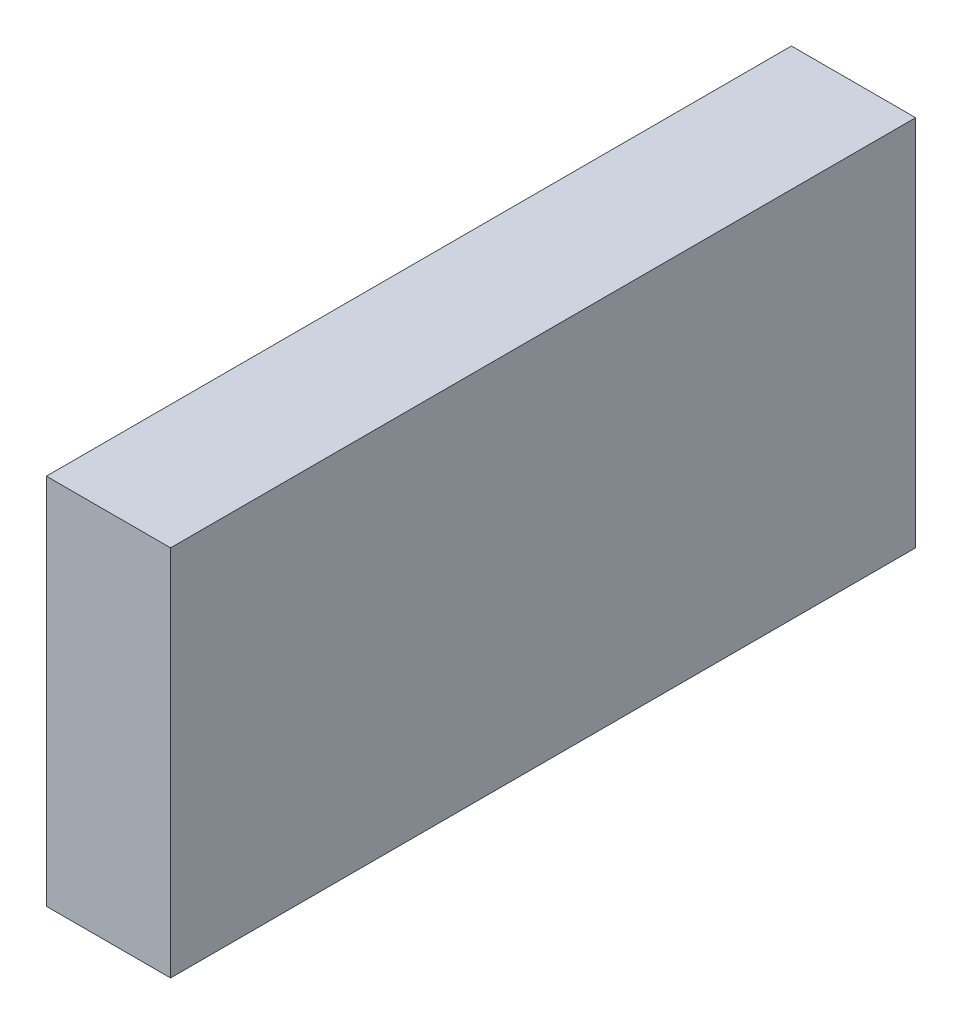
ISO-10303-21;
HEADER;
FILE_DESCRIPTION(('STEP AP214'),'2;1');
FILE_NAME('part.step','',(''),(''),'','','');
FILE_SCHEMA(('AUTOMOTIVE_DESIGN { 1 0 10303 214 1 1 1 1 }'));
ENDSEC;
DATA;
#1=APPLICATION_CONTEXT('core data for automotive mechanical design processes');
#2=APPLICATION_PROTOCOL_DEFINITION('international standard','automotive_design',2000,#1);
#3=PRODUCT_CONTEXT('',#1,'mechanical');
#4=PRODUCT('Part','Part','',(#3));
#5=PRODUCT_RELATED_PRODUCT_CATEGORY('part','',(#4));
#6=PRODUCT_DEFINITION_FORMATION('','',#4);
#7=PRODUCT_DEFINITION_CONTEXT('part definition',#1,'design');
#8=PRODUCT_DEFINITION('design','',#6,#7);
#9=PRODUCT_DEFINITION_SHAPE('','',#8);
#10=(LENGTH_UNIT() NAMED_UNIT(*) SI_UNIT(.MILLI.,.METRE.));
#11=(NAMED_UNIT(*) PLANE_ANGLE_UNIT() SI_UNIT($,.RADIAN.));
#12=(NAMED_UNIT(*) SI_UNIT($,.STERADIAN.) SOLID_ANGLE_UNIT());
#13=UNCERTAINTY_MEASURE_WITH_UNIT(LENGTH_MEASURE(1.E-05),#10,'distance_accuracy_value','');
#14=(GEOMETRIC_REPRESENTATION_CONTEXT(3) GLOBAL_UNCERTAINTY_ASSIGNED_CONTEXT((#13)) GLOBAL_UNIT_ASSIGNED_CONTEXT((#10,
#11,#12)) REPRESENTATION_CONTEXT('',''));
#15=CARTESIAN_POINT('',(0.,0.,0.));
#16=DIRECTION('',(0.,0.,1.));
#17=DIRECTION('',(1.,0.,0.));
#18=AXIS2_PLACEMENT_3D('',#15,#16,#17);
#19=CARTESIAN_POINT('',(12.7,0.,0.));
#20=DIRECTION('',(0.,0.,-1.));
#21=DIRECTION('',(0.,1.,0.));
#22=AXIS2_PLACEMENT_3D('',#19,#20,#21);
#23=PLANE('',#22);
#24=DIRECTION('',(0.,-1.,0.));
#25=VECTOR('',#24,1.);
#26=CARTESIAN_POINT('',(0.,0.,0.));
#27=LINE('',#26,#25);
#28=CARTESIAN_POINT('',(0.,38.1,0.));
#29=VERTEX_POINT('',#28);
#30=CARTESIAN_POINT('',(0.,0.,0.));
#31=VERTEX_POINT('',#30);
#32=EDGE_CURVE('E96',#29,#31,#27,.T.);
#33=ORIENTED_EDGE('',*,*,#32,.T.);
#34=DIRECTION('',(-1.,0.,0.));
#35=VECTOR('',#34,1.);
#36=CARTESIAN_POINT('',(12.7,0.,0.));
#37=LINE('',#36,#35);
#38=CARTESIAN_POINT('',(12.7,0.,0.));
#39=VERTEX_POINT('',#38);
#40=EDGE_CURVE('E11',#39,#31,#37,.T.);
#41=ORIENTED_EDGE('',*,*,#40,.F.);
#42=DIRECTION('',(0.,-1.,0.));
#43=VECTOR('',#42,1.);
#44=CARTESIAN_POINT('',(12.7,0.,0.));
#45=LINE('',#44,#43);
#46=CARTESIAN_POINT('',(12.7,38.1,0.));
#47=VERTEX_POINT('',#46);
#48=EDGE_CURVE('E84',#47,#39,#45,.T.);
#49=ORIENTED_EDGE('',*,*,#48,.F.);
#50=DIRECTION('',(-1.,0.,0.));
#51=VECTOR('',#50,1.);
#52=CARTESIAN_POINT('',(12.7,38.1,0.));
#53=LINE('',#52,#51);
#54=EDGE_CURVE('E92',#47,#29,#53,.T.);
#55=ORIENTED_EDGE('',*,*,#54,.T.);
#56=EDGE_LOOP('',(#33,#41,#49,#55));
#57=FACE_BOUND('',#56,.T.);
#58=ADVANCED_FACE('F33',(#57),#23,.F.);
#59=CARTESIAN_POINT('',(12.7,0.,0.));
#60=DIRECTION('',(0.,1.,0.));
#61=DIRECTION('',(0.,0.,1.));
#62=AXIS2_PLACEMENT_3D('',#59,#60,#61);
#63=PLANE('',#62);
#64=DIRECTION('',(0.,0.,-1.));
#65=VECTOR('',#64,1.);
#66=CARTESIAN_POINT('',(0.,0.,0.));
#67=LINE('',#66,#65);
#68=CARTESIAN_POINT('',(0.,0.,-76.2));
#69=VERTEX_POINT('',#68);
#70=EDGE_CURVE('E88',#31,#69,#67,.T.);
#71=ORIENTED_EDGE('',*,*,#70,.T.);
#72=DIRECTION('',(-1.,0.,0.));
#73=VECTOR('',#72,1.);
#74=CARTESIAN_POINT('',(12.7,0.,-76.2));
#75=LINE('',#74,#73);
#76=CARTESIAN_POINT('',(12.7,0.,-76.2));
#77=VERTEX_POINT('',#76);
#78=EDGE_CURVE('E41',#77,#69,#75,.T.);
#79=ORIENTED_EDGE('',*,*,#78,.F.);
#80=DIRECTION('',(0.,0.,-1.));
#81=VECTOR('',#80,1.);
#82=CARTESIAN_POINT('',(12.7,0.,0.));
#83=LINE('',#82,#81);
#84=EDGE_CURVE('E79',#39,#77,#83,.T.);
#85=ORIENTED_EDGE('',*,*,#84,.F.);
#86=ORIENTED_EDGE('',*,*,#40,.T.);
#87=EDGE_LOOP('',(#71,#79,#85,#86));
#88=FACE_BOUND('',#87,.T.);
#89=ADVANCED_FACE('F87',(#88),#63,.F.);
#90=CARTESIAN_POINT('',(12.7,0.,-76.2));
#91=DIRECTION('',(0.,0.,1.));
#92=DIRECTION('',(0.,-1.,0.));
#93=AXIS2_PLACEMENT_3D('',#90,#91,#92);
#94=PLANE('',#93);
#95=DIRECTION('',(0.,1.,0.));
#96=VECTOR('',#95,1.);
#97=CARTESIAN_POINT('',(0.,0.,-76.2));
#98=LINE('',#97,#96);
#99=CARTESIAN_POINT('',(0.,38.1,-76.2));
#100=VERTEX_POINT('',#99);
#101=EDGE_CURVE('E66',#69,#100,#98,.T.);
#102=ORIENTED_EDGE('',*,*,#101,.T.);
#103=DIRECTION('',(-1.,0.,0.));
#104=VECTOR('',#103,1.);
#105=CARTESIAN_POINT('',(12.7,38.1,-76.2));
#106=LINE('',#105,#104);
#107=CARTESIAN_POINT('',(12.7,38.1,-76.2));
#108=VERTEX_POINT('',#107);
#109=EDGE_CURVE('E89',#108,#100,#106,.T.);
#110=ORIENTED_EDGE('',*,*,#109,.F.);
#111=DIRECTION('',(0.,1.,0.));
#112=VECTOR('',#111,1.);
#113=CARTESIAN_POINT('',(12.7,0.,-76.2));
#114=LINE('',#113,#112);
#115=EDGE_CURVE('E82',#77,#108,#114,.T.);
#116=ORIENTED_EDGE('',*,*,#115,.F.);
#117=ORIENTED_EDGE('',*,*,#78,.T.);
#118=EDGE_LOOP('',(#102,#110,#116,#117));
#119=FACE_BOUND('',#118,.T.);
#120=ADVANCED_FACE('F90',(#119),#94,.F.);
#121=CARTESIAN_POINT('',(12.7,38.1,0.));
#122=DIRECTION('',(0.,-1.,0.));
#123=DIRECTION('',(0.,0.,-1.));
#124=AXIS2_PLACEMENT_3D('',#121,#122,#123);
#125=PLANE('',#124);
#126=DIRECTION('',(0.,0.,1.));
#127=VECTOR('',#126,1.);
#128=CARTESIAN_POINT('',(0.,38.1,0.));
#129=LINE('',#128,#127);
#130=EDGE_CURVE('E72',#100,#29,#129,.T.);
#131=ORIENTED_EDGE('',*,*,#130,.T.);
#132=ORIENTED_EDGE('',*,*,#54,.F.);
#133=DIRECTION('',(0.,0.,1.));
#134=VECTOR('',#133,1.);
#135=CARTESIAN_POINT('',(12.7,38.1,0.));
#136=LINE('',#135,#134);
#137=EDGE_CURVE('E49',#108,#47,#136,.T.);
#138=ORIENTED_EDGE('',*,*,#137,.F.);
#139=ORIENTED_EDGE('',*,*,#109,.T.);
#140=EDGE_LOOP('',(#131,#132,#138,#139));
#141=FACE_BOUND('',#140,.T.);
#142=ADVANCED_FACE('F103',(#141),#125,.F.);
#143=CARTESIAN_POINT('',(12.7,0.,0.));
#144=DIRECTION('',(-1.,0.,0.));
#145=DIRECTION('',(0.,0.,1.));
#146=AXIS2_PLACEMENT_3D('',#143,#144,#145);
#147=PLANE('',#146);
#148=ORIENTED_EDGE('',*,*,#48,.T.);
#149=ORIENTED_EDGE('',*,*,#84,.T.);
#150=ORIENTED_EDGE('',*,*,#115,.T.);
#151=ORIENTED_EDGE('',*,*,#137,.T.);
#152=EDGE_LOOP('',(#148,#149,#150,#151));
#153=FACE_BOUND('',#152,.T.);
#154=ADVANCED_FACE('F80',(#153),#147,.F.);
#155=CARTESIAN_POINT('',(0.,0.,0.));
#156=DIRECTION('',(-1.,0.,0.));
#157=DIRECTION('',(0.,0.,1.));
#158=AXIS2_PLACEMENT_3D('',#155,#156,#157);
#159=PLANE('',#158);
#160=ORIENTED_EDGE('',*,*,#32,.F.);
#161=ORIENTED_EDGE('',*,*,#130,.F.);
#162=ORIENTED_EDGE('',*,*,#101,.F.);
#163=ORIENTED_EDGE('',*,*,#70,.F.);
#164=EDGE_LOOP('',(#160,#161,#162,#163));
#165=FACE_BOUND('',#164,.T.);
#166=ADVANCED_FACE('F106',(#165),#159,.T.);
#167=CLOSED_SHELL('',(#58,#89,#120,#142,#154,#166));
#168=MANIFOLD_SOLID_BREP('B2',#167);
#169=ADVANCED_BREP_SHAPE_REPRESENTATION('',(#18,#168),#14);
#170=SHAPE_DEFINITION_REPRESENTATION(#9,#169);
ENDSEC;
END-ISO-10303-21;
